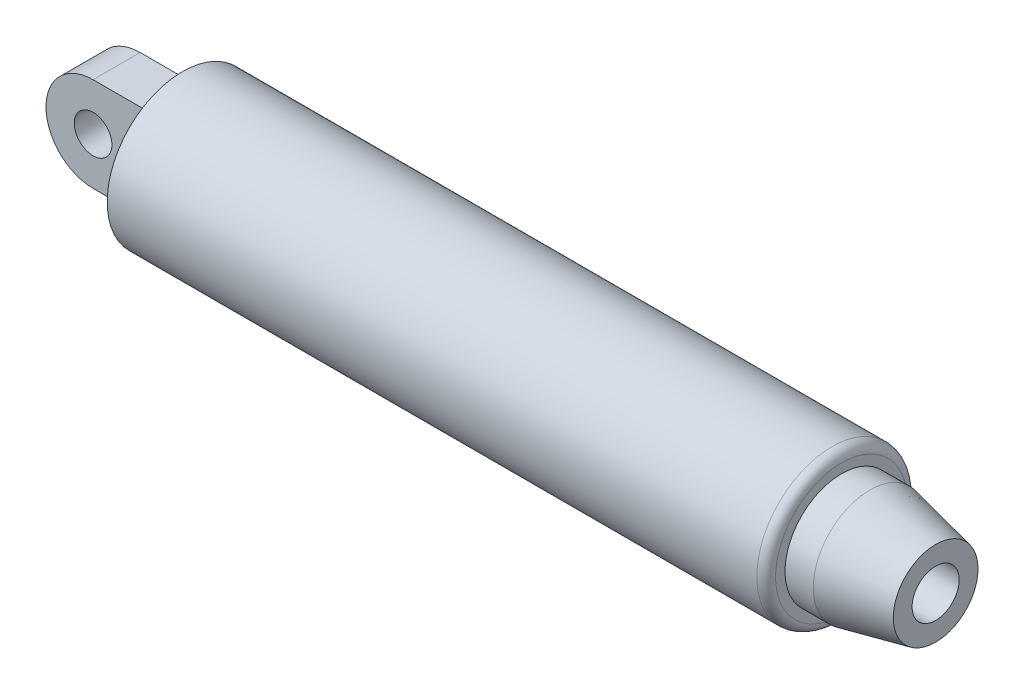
ISO-10303-21;
HEADER;
FILE_DESCRIPTION(('STEP AP214'),'2;1');
FILE_NAME('part.step','',(''),(''),'','','');
FILE_SCHEMA(('AUTOMOTIVE_DESIGN { 1 0 10303 214 1 1 1 1 }'));
ENDSEC;
DATA;
#1=APPLICATION_CONTEXT('core data for automotive mechanical design processes');
#2=APPLICATION_PROTOCOL_DEFINITION('international standard','automotive_design',2000,#1);
#3=PRODUCT_CONTEXT('',#1,'mechanical');
#4=PRODUCT('Part','Part','',(#3));
#5=PRODUCT_RELATED_PRODUCT_CATEGORY('part','',(#4));
#6=PRODUCT_DEFINITION_FORMATION('','',#4);
#7=PRODUCT_DEFINITION_CONTEXT('part definition',#1,'design');
#8=PRODUCT_DEFINITION('design','',#6,#7);
#9=PRODUCT_DEFINITION_SHAPE('','',#8);
#10=(LENGTH_UNIT() NAMED_UNIT(*) SI_UNIT(.MILLI.,.METRE.));
#11=(NAMED_UNIT(*) PLANE_ANGLE_UNIT() SI_UNIT($,.RADIAN.));
#12=(NAMED_UNIT(*) SI_UNIT($,.STERADIAN.) SOLID_ANGLE_UNIT());
#13=UNCERTAINTY_MEASURE_WITH_UNIT(LENGTH_MEASURE(1.E-05),#10,'distance_accuracy_value','');
#14=(GEOMETRIC_REPRESENTATION_CONTEXT(3) GLOBAL_UNCERTAINTY_ASSIGNED_CONTEXT((#13)) GLOBAL_UNIT_ASSIGNED_CONTEXT((#10,
#11,#12)) REPRESENTATION_CONTEXT('',''));
#15=CARTESIAN_POINT('',(0.,0.,0.));
#16=DIRECTION('',(0.,0.,1.));
#17=DIRECTION('',(1.,0.,0.));
#18=AXIS2_PLACEMENT_3D('',#15,#16,#17);
#19=CARTESIAN_POINT('',(0.,0.,0.));
#20=DIRECTION('',(1.,0.,0.));
#21=DIRECTION('',(0.,0.,-1.));
#22=AXIS2_PLACEMENT_3D('',#19,#20,#21);
#23=PLANE('',#22);
#24=CARTESIAN_POINT('',(0.,0.,0.));
#25=DIRECTION('',(1.,0.,0.));
#26=DIRECTION('',(0.,0.,-1.));
#27=AXIS2_PLACEMENT_3D('',#24,#25,#26);
#28=CIRCLE('',#27,80.);
#29=CARTESIAN_POINT('',(0.,0.,-80.));
#30=VERTEX_POINT('',#29);
#31=EDGE_CURVE('E108',#30,#30,#28,.T.);
#32=ORIENTED_EDGE('',*,*,#31,.F.);
#33=EDGE_LOOP('',(#32));
#34=FACE_BOUND('',#33,.T.);
#35=DIRECTION('',(0.,0.,-1.));
#36=VECTOR('',#35,1.);
#37=CARTESIAN_POINT('',(0.,-50.,25.));
#38=LINE('',#37,#36);
#39=CARTESIAN_POINT('',(0.,-50.,25.));
#40=VERTEX_POINT('',#39);
#41=CARTESIAN_POINT('',(0.,-50.,-25.));
#42=VERTEX_POINT('',#41);
#43=EDGE_CURVE('E53',#40,#42,#38,.T.);
#44=ORIENTED_EDGE('',*,*,#43,.T.);
#45=DIRECTION('',(0.,1.,0.));
#46=VECTOR('',#45,1.);
#47=CARTESIAN_POINT('',(0.,50.,-25.));
#48=LINE('',#47,#46);
#49=CARTESIAN_POINT('',(0.,50.,-25.));
#50=VERTEX_POINT('',#49);
#51=EDGE_CURVE('E205',#42,#50,#48,.T.);
#52=ORIENTED_EDGE('',*,*,#51,.T.);
#53=DIRECTION('',(0.,0.,-1.));
#54=VECTOR('',#53,1.);
#55=CARTESIAN_POINT('',(0.,50.,25.));
#56=LINE('',#55,#54);
#57=CARTESIAN_POINT('',(0.,50.,25.));
#58=VERTEX_POINT('',#57);
#59=EDGE_CURVE('E99',#58,#50,#56,.T.);
#60=ORIENTED_EDGE('',*,*,#59,.F.);
#61=DIRECTION('',(0.,1.,0.));
#62=VECTOR('',#61,1.);
#63=CARTESIAN_POINT('',(0.,50.,25.));
#64=LINE('',#63,#62);
#65=EDGE_CURVE('E48',#40,#58,#64,.T.);
#66=ORIENTED_EDGE('',*,*,#65,.F.);
#67=EDGE_LOOP('',(#44,#52,#60,#66));
#68=FACE_BOUND('',#67,.T.);
#69=ADVANCED_FACE('F33',(#34,#68),#23,.F.);
#70=CARTESIAN_POINT('',(700.,0.,0.));
#71=DIRECTION('',(1.,0.,0.));
#72=DIRECTION('',(0.,0.,-1.));
#73=AXIS2_PLACEMENT_3D('',#70,#71,#72);
#74=PLANE('',#73);
#75=CARTESIAN_POINT('',(700.,0.,0.));
#76=DIRECTION('',(1.,0.,0.));
#77=DIRECTION('',(0.,0.,-1.));
#78=AXIS2_PLACEMENT_3D('',#75,#76,#77);
#79=CIRCLE('',#78,70.);
#80=CARTESIAN_POINT('',(700.,0.,-70.));
#81=VERTEX_POINT('',#80);
#82=EDGE_CURVE('E41',#81,#81,#79,.T.);
#83=ORIENTED_EDGE('',*,*,#82,.T.);
#84=EDGE_LOOP('',(#83));
#85=FACE_BOUND('',#84,.T.);
#86=CARTESIAN_POINT('',(700.,0.,0.));
#87=DIRECTION('',(1.,0.,0.));
#88=DIRECTION('',(0.,0.,-1.));
#89=AXIS2_PLACEMENT_3D('',#86,#87,#88);
#90=CIRCLE('',#89,60.);
#91=CARTESIAN_POINT('',(700.,0.,-60.));
#92=VERTEX_POINT('',#91);
#93=EDGE_CURVE('E104',#92,#92,#90,.T.);
#94=ORIENTED_EDGE('',*,*,#93,.F.);
#95=EDGE_LOOP('',(#94));
#96=FACE_BOUND('',#95,.T.);
#97=ADVANCED_FACE('F119',(#85,#96),#74,.T.);
#98=CARTESIAN_POINT('',(700.,0.,0.));
#99=DIRECTION('',(-1.,0.,0.));
#100=DIRECTION('',(0.,0.,1.));
#101=AXIS2_PLACEMENT_3D('',#98,#99,#100);
#102=CYLINDRICAL_SURFACE('',#101,80.);
#103=CARTESIAN_POINT('',(690.,0.,0.));
#104=DIRECTION('',(1.,0.,0.));
#105=DIRECTION('',(0.,0.,-1.));
#106=AXIS2_PLACEMENT_3D('',#103,#104,#105);
#107=CIRCLE('',#106,80.);
#108=CARTESIAN_POINT('',(690.,0.,-80.));
#109=VERTEX_POINT('',#108);
#110=EDGE_CURVE('E11',#109,#109,#107,.F.);
#111=ORIENTED_EDGE('',*,*,#110,.T.);
#112=EDGE_LOOP('',(#111));
#113=FACE_BOUND('',#112,.T.);
#114=ORIENTED_EDGE('',*,*,#31,.T.);
#115=EDGE_LOOP('',(#114));
#116=FACE_BOUND('',#115,.T.);
#117=ADVANCED_FACE('F141',(#113,#116),#102,.T.);
#118=CARTESIAN_POINT('',(800.,0.,0.));
#119=DIRECTION('',(-1.,0.,0.));
#120=DIRECTION('',(0.,0.,1.));
#121=AXIS2_PLACEMENT_3D('',#118,#119,#120);
#122=CYLINDRICAL_SURFACE('',#121,60.);
#123=CARTESIAN_POINT('',(729.999999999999,0.,0.));
#124=DIRECTION('',(1.,0.,0.));
#125=DIRECTION('',(0.,0.,-1.));
#126=AXIS2_PLACEMENT_3D('',#123,#124,#125);
#127=CIRCLE('',#126,60.);
#128=CARTESIAN_POINT('',(729.999999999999,0.,-60.));
#129=VERTEX_POINT('',#128);
#130=EDGE_CURVE('E114',#129,#129,#127,.F.);
#131=ORIENTED_EDGE('',*,*,#130,.T.);
#132=EDGE_LOOP('',(#131));
#133=FACE_BOUND('',#132,.T.);
#134=ORIENTED_EDGE('',*,*,#93,.T.);
#135=EDGE_LOOP('',(#134));
#136=FACE_BOUND('',#135,.T.);
#137=ADVANCED_FACE('F147',(#133,#136),#122,.T.);
#138=CARTESIAN_POINT('',(800.,0.,0.));
#139=DIRECTION('',(1.,0.,0.));
#140=DIRECTION('',(0.,0.,-1.));
#141=AXIS2_PLACEMENT_3D('',#138,#139,#140);
#142=PLANE('',#141);
#143=CARTESIAN_POINT('',(800.,0.,0.));
#144=DIRECTION('',(1.,0.,0.));
#145=DIRECTION('',(0.,0.,-1.));
#146=AXIS2_PLACEMENT_3D('',#143,#144,#145);
#147=CIRCLE('',#146,25.);
#148=CARTESIAN_POINT('',(800.,0.,-25.));
#149=VERTEX_POINT('',#148);
#150=EDGE_CURVE('E94',#149,#149,#147,.T.);
#151=ORIENTED_EDGE('',*,*,#150,.F.);
#152=EDGE_LOOP('',(#151));
#153=FACE_BOUND('',#152,.T.);
#154=CARTESIAN_POINT('',(800.,0.,0.));
#155=DIRECTION('',(1.,0.,0.));
#156=DIRECTION('',(0.,0.,-1.));
#157=AXIS2_PLACEMENT_3D('',#154,#155,#156);
#158=CIRCLE('',#157,45.0000000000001);
#159=CARTESIAN_POINT('',(800.,0.,-45.0000000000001));
#160=VERTEX_POINT('',#159);
#161=EDGE_CURVE('E111',#160,#160,#158,.T.);
#162=ORIENTED_EDGE('',*,*,#161,.T.);
#163=EDGE_LOOP('',(#162));
#164=FACE_BOUND('',#163,.T.);
#165=ADVANCED_FACE('F151',(#153,#164),#142,.T.);
#166=CARTESIAN_POINT('',(800.,0.,0.));
#167=DIRECTION('',(-1.,0.,0.));
#168=DIRECTION('',(0.,0.,1.));
#169=AXIS2_PLACEMENT_3D('',#166,#167,#168);
#170=CONICAL_SURFACE('',#169,45.0000000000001,0.211093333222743);
#171=ORIENTED_EDGE('',*,*,#130,.F.);
#172=EDGE_LOOP('',(#171));
#173=FACE_BOUND('',#172,.T.);
#174=ORIENTED_EDGE('',*,*,#161,.F.);
#175=EDGE_LOOP('',(#174));
#176=FACE_BOUND('',#175,.T.);
#177=ADVANCED_FACE('F149',(#173,#176),#170,.T.);
#178=CARTESIAN_POINT('',(400.,0.,0.));
#179=DIRECTION('',(1.,0.,0.));
#180=DIRECTION('',(0.,0.,-1.));
#181=AXIS2_PLACEMENT_3D('',#178,#179,#180);
#182=CYLINDRICAL_SURFACE('',#181,25.);
#183=CARTESIAN_POINT('',(400.,0.,0.));
#184=DIRECTION('',(1.,0.,0.));
#185=DIRECTION('',(0.,0.,-1.));
#186=AXIS2_PLACEMENT_3D('',#183,#184,#185);
#187=CIRCLE('',#186,25.);
#188=CARTESIAN_POINT('',(400.,0.,-25.));
#189=VERTEX_POINT('',#188);
#190=EDGE_CURVE('E97',#189,#189,#187,.T.);
#191=ORIENTED_EDGE('',*,*,#190,.F.);
#192=EDGE_LOOP('',(#191));
#193=FACE_BOUND('',#192,.T.);
#194=ORIENTED_EDGE('',*,*,#150,.T.);
#195=EDGE_LOOP('',(#194));
#196=FACE_BOUND('',#195,.T.);
#197=ADVANCED_FACE('F131',(#193,#196),#182,.F.);
#198=CARTESIAN_POINT('',(400.,0.,0.));
#199=DIRECTION('',(1.,0.,0.));
#200=DIRECTION('',(0.,0.,-1.));
#201=AXIS2_PLACEMENT_3D('',#198,#199,#200);
#202=PLANE('',#201);
#203=ORIENTED_EDGE('',*,*,#190,.T.);
#204=EDGE_LOOP('',(#203));
#205=FACE_BOUND('',#204,.T.);
#206=ADVANCED_FACE('F123',(#205),#202,.T.);
#207=CARTESIAN_POINT('',(690.,0.,0.));
#208=DIRECTION('',(1.,0.,0.));
#209=DIRECTION('',(0.,0.,-1.));
#210=AXIS2_PLACEMENT_3D('',#207,#208,#209);
#211=TOROIDAL_SURFACE('',#210,70.,10.);
#212=ORIENTED_EDGE('',*,*,#110,.F.);
#213=EDGE_LOOP('',(#212));
#214=FACE_BOUND('',#213,.T.);
#215=ORIENTED_EDGE('',*,*,#82,.F.);
#216=EDGE_LOOP('',(#215));
#217=FACE_BOUND('',#216,.T.);
#218=ADVANCED_FACE('F35',(#214,#217),#211,.T.);
#219=CARTESIAN_POINT('',(-70.,0.,25.));
#220=DIRECTION('',(0.,0.,1.));
#221=DIRECTION('',(1.,0.,0.));
#222=AXIS2_PLACEMENT_3D('',#219,#220,#221);
#223=PLANE('',#222);
#224=CARTESIAN_POINT('',(-70.,0.,25.));
#225=DIRECTION('',(0.,0.,1.));
#226=DIRECTION('',(1.,0.,0.));
#227=AXIS2_PLACEMENT_3D('',#224,#225,#226);
#228=CIRCLE('',#227,50.);
#229=CARTESIAN_POINT('',(-70.,50.,25.));
#230=VERTEX_POINT('',#229);
#231=CARTESIAN_POINT('',(-70.,-50.,25.));
#232=VERTEX_POINT('',#231);
#233=EDGE_CURVE('E79',#230,#232,#228,.T.);
#234=ORIENTED_EDGE('',*,*,#233,.T.);
#235=DIRECTION('',(1.,0.,0.));
#236=VECTOR('',#235,1.);
#237=CARTESIAN_POINT('',(0.,-50.,25.));
#238=LINE('',#237,#236);
#239=EDGE_CURVE('E72',#232,#40,#238,.T.);
#240=ORIENTED_EDGE('',*,*,#239,.T.);
#241=ORIENTED_EDGE('',*,*,#65,.T.);
#242=DIRECTION('',(-1.,0.,0.));
#243=VECTOR('',#242,1.);
#244=CARTESIAN_POINT('',(-70.,50.,25.));
#245=LINE('',#244,#243);
#246=EDGE_CURVE('E85',#58,#230,#245,.T.);
#247=ORIENTED_EDGE('',*,*,#246,.T.);
#248=EDGE_LOOP('',(#234,#240,#241,#247));
#249=FACE_BOUND('',#248,.T.);
#250=CARTESIAN_POINT('',(-70.,0.,25.));
#251=DIRECTION('',(0.,0.,1.));
#252=DIRECTION('',(1.,0.,0.));
#253=AXIS2_PLACEMENT_3D('',#250,#251,#252);
#254=CIRCLE('',#253,20.);
#255=CARTESIAN_POINT('',(-50.,0.,25.));
#256=VERTEX_POINT('',#255);
#257=EDGE_CURVE('E191',#256,#256,#254,.T.);
#258=ORIENTED_EDGE('',*,*,#257,.F.);
#259=EDGE_LOOP('',(#258));
#260=FACE_BOUND('',#259,.T.);
#261=ADVANCED_FACE('F82',(#249,#260),#223,.T.);
#262=CARTESIAN_POINT('',(-70.,0.,-25.));
#263=DIRECTION('',(0.,0.,1.));
#264=DIRECTION('',(1.,0.,0.));
#265=AXIS2_PLACEMENT_3D('',#262,#263,#264);
#266=PLANE('',#265);
#267=CARTESIAN_POINT('',(-70.,0.,-25.));
#268=DIRECTION('',(0.,0.,1.));
#269=DIRECTION('',(1.,0.,0.));
#270=AXIS2_PLACEMENT_3D('',#267,#268,#269);
#271=CIRCLE('',#270,50.);
#272=CARTESIAN_POINT('',(-70.,50.,-25.));
#273=VERTEX_POINT('',#272);
#274=CARTESIAN_POINT('',(-70.,-50.,-25.));
#275=VERTEX_POINT('',#274);
#276=EDGE_CURVE('E93',#273,#275,#271,.T.);
#277=ORIENTED_EDGE('',*,*,#276,.F.);
#278=DIRECTION('',(-1.,0.,0.));
#279=VECTOR('',#278,1.);
#280=CARTESIAN_POINT('',(-70.,50.,-25.));
#281=LINE('',#280,#279);
#282=EDGE_CURVE('E89',#50,#273,#281,.T.);
#283=ORIENTED_EDGE('',*,*,#282,.F.);
#284=ORIENTED_EDGE('',*,*,#51,.F.);
#285=DIRECTION('',(1.,0.,0.));
#286=VECTOR('',#285,1.);
#287=CARTESIAN_POINT('',(0.,-50.,-25.));
#288=LINE('',#287,#286);
#289=EDGE_CURVE('E203',#275,#42,#288,.T.);
#290=ORIENTED_EDGE('',*,*,#289,.F.);
#291=EDGE_LOOP('',(#277,#283,#284,#290));
#292=FACE_BOUND('',#291,.T.);
#293=CARTESIAN_POINT('',(-70.,0.,-25.));
#294=DIRECTION('',(0.,0.,1.));
#295=DIRECTION('',(1.,0.,0.));
#296=AXIS2_PLACEMENT_3D('',#293,#294,#295);
#297=CIRCLE('',#296,20.);
#298=CARTESIAN_POINT('',(-50.,0.,-25.));
#299=VERTEX_POINT('',#298);
#300=EDGE_CURVE('E194',#299,#299,#297,.T.);
#301=ORIENTED_EDGE('',*,*,#300,.T.);
#302=EDGE_LOOP('',(#301));
#303=FACE_BOUND('',#302,.T.);
#304=ADVANCED_FACE('F129',(#292,#303),#266,.F.);
#305=CARTESIAN_POINT('',(-70.,0.,25.));
#306=DIRECTION('',(0.,0.,-1.));
#307=DIRECTION('',(-1.,0.,0.));
#308=AXIS2_PLACEMENT_3D('',#305,#306,#307);
#309=CYLINDRICAL_SURFACE('',#308,50.);
#310=ORIENTED_EDGE('',*,*,#276,.T.);
#311=DIRECTION('',(0.,0.,-1.));
#312=VECTOR('',#311,1.);
#313=CARTESIAN_POINT('',(-70.,-50.,25.));
#314=LINE('',#313,#312);
#315=EDGE_CURVE('E76',#232,#275,#314,.T.);
#316=ORIENTED_EDGE('',*,*,#315,.F.);
#317=ORIENTED_EDGE('',*,*,#233,.F.);
#318=DIRECTION('',(0.,0.,-1.));
#319=VECTOR('',#318,1.);
#320=CARTESIAN_POINT('',(-70.,50.,25.));
#321=LINE('',#320,#319);
#322=EDGE_CURVE('E201',#230,#273,#321,.T.);
#323=ORIENTED_EDGE('',*,*,#322,.T.);
#324=EDGE_LOOP('',(#310,#316,#317,#323));
#325=FACE_BOUND('',#324,.T.);
#326=ADVANCED_FACE('F91',(#325),#309,.T.);
#327=CARTESIAN_POINT('',(0.,-50.,25.));
#328=DIRECTION('',(0.,1.,0.));
#329=DIRECTION('',(0.,0.,1.));
#330=AXIS2_PLACEMENT_3D('',#327,#328,#329);
#331=PLANE('',#330);
#332=ORIENTED_EDGE('',*,*,#289,.T.);
#333=ORIENTED_EDGE('',*,*,#43,.F.);
#334=ORIENTED_EDGE('',*,*,#239,.F.);
#335=ORIENTED_EDGE('',*,*,#315,.T.);
#336=EDGE_LOOP('',(#332,#333,#334,#335));
#337=FACE_BOUND('',#336,.T.);
#338=ADVANCED_FACE('F74',(#337),#331,.F.);
#339=CARTESIAN_POINT('',(-70.,50.,25.));
#340=DIRECTION('',(0.,-1.,0.));
#341=DIRECTION('',(0.,0.,-1.));
#342=AXIS2_PLACEMENT_3D('',#339,#340,#341);
#343=PLANE('',#342);
#344=ORIENTED_EDGE('',*,*,#282,.T.);
#345=ORIENTED_EDGE('',*,*,#322,.F.);
#346=ORIENTED_EDGE('',*,*,#246,.F.);
#347=ORIENTED_EDGE('',*,*,#59,.T.);
#348=EDGE_LOOP('',(#344,#345,#346,#347));
#349=FACE_BOUND('',#348,.T.);
#350=ADVANCED_FACE('F176',(#349),#343,.F.);
#351=CARTESIAN_POINT('',(-70.,0.,25.));
#352=DIRECTION('',(0.,0.,-1.));
#353=DIRECTION('',(-1.,0.,0.));
#354=AXIS2_PLACEMENT_3D('',#351,#352,#353);
#355=CYLINDRICAL_SURFACE('',#354,20.);
#356=ORIENTED_EDGE('',*,*,#257,.T.);
#357=EDGE_LOOP('',(#356));
#358=FACE_BOUND('',#357,.T.);
#359=ORIENTED_EDGE('',*,*,#300,.F.);
#360=EDGE_LOOP('',(#359));
#361=FACE_BOUND('',#360,.T.);
#362=ADVANCED_FACE('F179',(#358,#361),#355,.F.);
#363=CLOSED_SHELL('',(#69,#97,#117,#137,#165,#177,#197,#206,#218,#261,#304,#326,#338,#350,#362));
#364=MANIFOLD_SOLID_BREP('B2',#363);
#365=ADVANCED_BREP_SHAPE_REPRESENTATION('',(#18,#364),#14);
#366=SHAPE_DEFINITION_REPRESENTATION(#9,#365);
ENDSEC;
END-ISO-10303-21;
